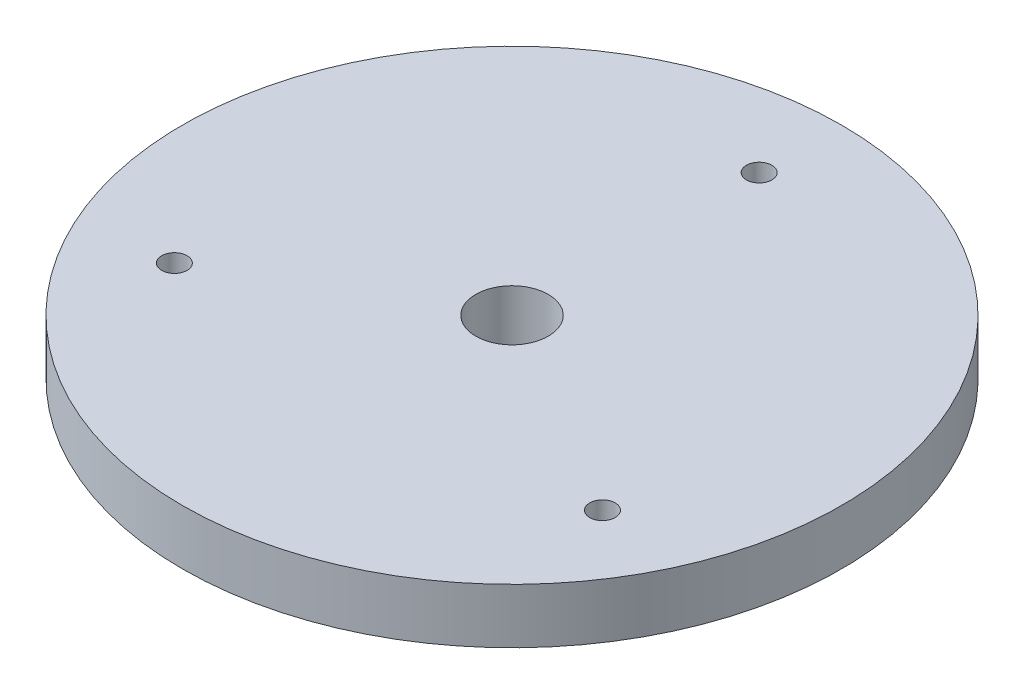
from build123d import *

# Parameters (mm, degrees)
SKETCH1_R           = 38.1
SKETCH1_R_2         = 1.4732
SKETCH1_R_3         = 4.191
BOSS_EXTRUDE1_DEPTH = 6.35


with BuildPart() as part:
    # Sketch1 → Boss-Extrude1 (new body)
    with BuildSketch(Plane(origin=(0, 0, 0), x_dir=(1, 0, 0), z_dir=(0, 1, 0))):
        with Locations(Location((0, 0, 0), (0, 0, 270))):
            Circle(SKETCH1_R)
        with Locations(Location((0, 28.575, 0), (0, 0, 270))):
            Circle(SKETCH1_R_2, mode=Mode.SUBTRACT)
        with Locations(Location((24.746675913, -14.2875, 0), (0, 0, 270))):
            Circle(SKETCH1_R_2, mode=Mode.SUBTRACT)
        with Locations(Location((-24.746675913, -14.2875, 0), (0, 0, 270))):
            Circle(SKETCH1_R_2, mode=Mode.SUBTRACT)
        with Locations(Location((0, 0, 0), (0, 0, 270))):
            Circle(SKETCH1_R_3, mode=Mode.SUBTRACT)
    extrude(amount=BOSS_EXTRUDE1_DEPTH)


solid = part.part
